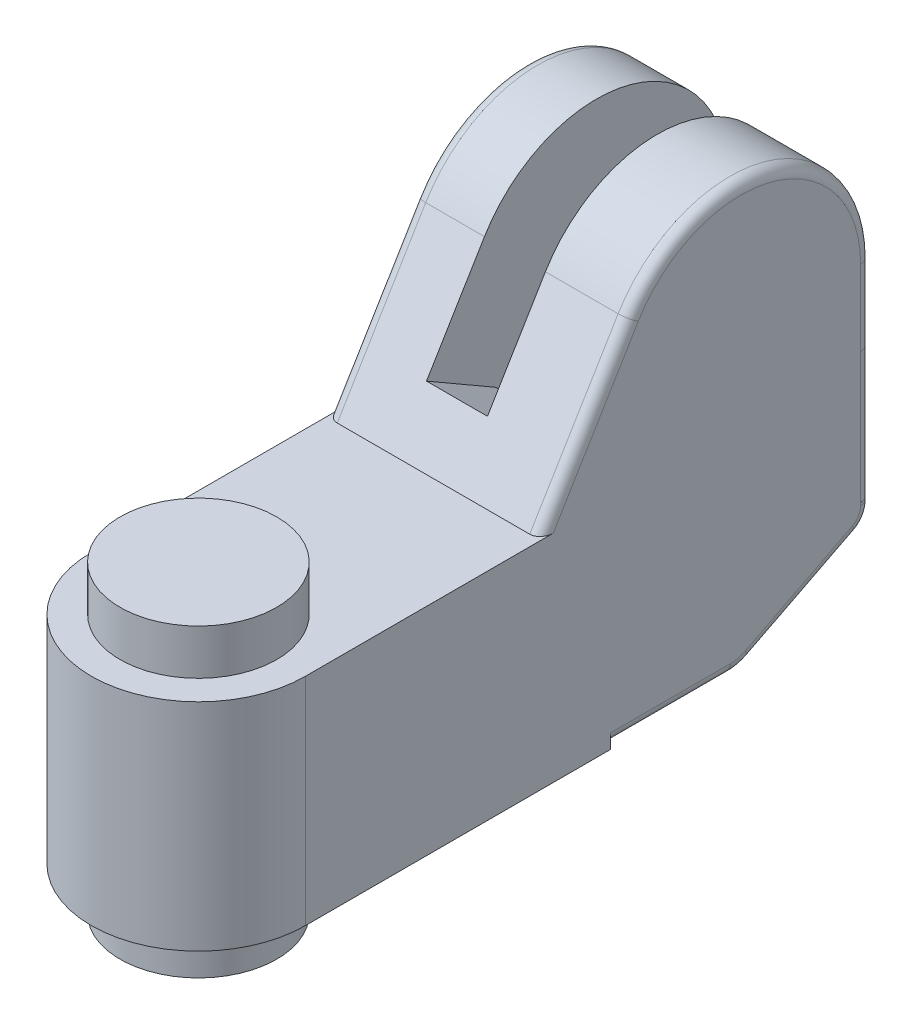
from build123d import *

# Parameters (mm, degrees)
BOSS_EXTRUDE1_DEPTH           = 12.3
CUT_EXTRUDE1_DEPTH            = 71.649345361
BOSS_EXTRUDE2_DEPTH           = 5
BOSS_EXTRUDE2_DEPTH_BACK      = 30
SKETCH3_R                     = 9
CUT_EXTRUDE2_START            = -15
CUT_EXTRUDE2_DEPTH            = 7
CUT_EXTRUDE3_DEPTH            = 14
CUT_EXTRUDE3_DEPTH_BACK       = 7
SKETCH5_R                     = 5
CUT_EXTRUDE4_DEPTH            = 1.25
FILLET1_R                     = 1.25
SKETCH8_R                     = 3.2
CUT_EXTRUDE6_DEPTH            = 25.9
SKETCH7_R                     = 1.5
SKETCH7_W                     = 24.6
SKETCH7_H                     = 0.01
CUT_EXTRUDE5_DEPTH            = 1.25
SKETCH9_R                     = 2.75
BOSS_EXTRUDE3_DEPTH           = 2
CHAMFER1_SIZE                 = 0.25
SKETCH10_R                    = 1.25
CUT_EXTRUDE7_DEPTH            = 0.1
CUT_EXTRUDE7_DRAFT            = -45
CUT_EXTRUDE7_PROFILE_2_DEPTH  = 0.1
CUT_EXTRUDE7_PROFILE_2_DRAFT  = -45
CUT_EXTRUDE7_PROFILE_3_DEPTH  = 0.1
CUT_EXTRUDE7_PROFILE_3_DRAFT  = -45
CUT_EXTRUDE7_PROFILE_4_DEPTH  = 0.1
CUT_EXTRUDE7_PROFILE_4_DRAFT  = -45
SKETCH11_W                    = 0.4
SKETCH11_H                    = 2.26495033
CUT_EXTRUDE8_DEPTH            = 0.2
CUT_EXTRUDE8_DRAFT            = -5
CUT_EXTRUDE8_PROFILE_2_DEPTH  = 0.2
CUT_EXTRUDE8_PROFILE_2_DRAFT  = -5
CUT_EXTRUDE8_PROFILE_3_DEPTH  = 0.2
CUT_EXTRUDE8_PROFILE_3_DRAFT  = -5
CUT_EXTRUDE8_PROFILE_4_DEPTH  = 0.2
CUT_EXTRUDE8_PROFILE_4_DRAFT  = -5
SKETCH12_R                    = 1.75
CUT_EXTRUDE9_DEPTH            = 0.1
CUT_EXTRUDE9_DRAFT            = -45
CUT_EXTRUDE9_PROFILE_2_DEPTH  = 0.1
CUT_EXTRUDE9_PROFILE_2_DRAFT  = -45
SKETCH13_W                    = 3.261901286
SKETCH13_H                    = 0.5
CUT_EXTRUDE10_DEPTH           = 0.2
CUT_EXTRUDE10_DRAFT           = -5
CUT_EXTRUDE10_PROFILE_2_DEPTH = 0.2
CUT_EXTRUDE10_PROFILE_2_DRAFT = -5


with BuildPart() as part:
    # Sketch1 → Boss-Extrude1 (new, symmetric)
    with BuildSketch(Plane(origin=(0, 0, 0), x_dir=(0, 0, -1), z_dir=(1, 0, 0))):
        with BuildLine():
            Line((-12.3, 0), (35, 0))
            Line((35, 0), (35, 0.4))
            Line((35, 0.4), (48.799606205, 0.4))
            ThreePointArc((48.799606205, 0.4), (49.966833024, 0.538150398), (51.069558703, 0.944967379))
            Line((51.069558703, 0.944967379), (63.361971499, 7.208264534))
            ThreePointArc((63.361971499, 7.208264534), (64.557920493, 8.313788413), (65, 9.881284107))
            Line((65, 9.881284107), (65, 33.9))
            ThreePointArc((65, 33.9), (54.018869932, 48.35159799), (37.153508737, 41.643879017))
            Line((37.153508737, 41.643879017), (27, 24.8))
            Line((27, 24.8), (-12.3, 24.8))
            Line((-12.3, 24.8), (-12.3, 0))
        make_face()
    extrude(amount=BOSS_EXTRUDE1_DEPTH, both=True)

    # Sketch2 → Cut-Extrude1 (cut, through all)
    with BuildSketch(Plane(origin=(0, 24.8, 0), x_dir=(1, 0, 0), z_dir=(0, 1, 0))):
        with BuildLine():
            Line((-12.3, 0), (-12.3, -13.3))
            Line((-12.3, -13.3), (12.3, -13.3))
            Line((12.3, -13.3), (12.3, 0))
            ThreePointArc((12.3, 0), (0, -12.3), (-12.3, 0))
        make_face()
    extrude(amount=-CUT_EXTRUDE1_DEPTH, mode=Mode.SUBTRACT)

    # Sketch3 → Boss-Extrude2 (add, two sides: drawn at the far end of the back side and taken through both)
    with BuildSketch(Plane.XZ.offset(-BOSS_EXTRUDE2_DEPTH_BACK)):
        with Locations(Location((0, 0, 0), (0, 0, 270))):
            Circle(SKETCH3_R)
    extrude(amount=BOSS_EXTRUDE2_DEPTH + BOSS_EXTRUDE2_DEPTH_BACK)

    # Sketch4 → Cut-Extrude2 (cut)
    with BuildSketch(Plane.ZY.offset(12.3).offset(CUT_EXTRUDE2_START)):
        with BuildLine():
            Line((-38.427724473, 26.020758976), (-30.496246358, 30.6))
            Line((-30.496246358, 30.6), (-37.153508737, 41.643879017))
            ThreePointArc((-37.153508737, 41.643879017), (-54.018869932, 48.35159799), (-65, 33.9))
            Line((-65, 33.9), (-65, 22.006887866))
            Line((-65, 22.006887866), (-63.8, 22.006887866))
            ThreePointArc((-63.8, 22.006887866), (-59.302339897, 21.905283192), (-54.941176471, 20.800962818))
            ThreePointArc((-54.941176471, 20.800962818), (-45.780469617, 20.551008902), (-38.427724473, 26.020758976))
        make_face()
    extrude(amount=CUT_EXTRUDE2_DEPTH, mode=Mode.SUBTRACT)

    # Sketch5 → Cut-Extrude3 (cut, two sides: drawn at the far end of the back side and taken through both)
    with BuildSketch(Plane.ZY.offset(-2.7).offset(-CUT_EXTRUDE3_DEPTH_BACK)):
        with Locations(Location((-50, 33.9, 0), (0, 0, 180))):
            Circle(SKETCH5_R)
    extrude(amount=CUT_EXTRUDE3_DEPTH + CUT_EXTRUDE3_DEPTH_BACK, mode=Mode.SUBTRACT)

    # Sketch6 → Cut-Extrude4 (cut)
    with BuildSketch(Plane.ZY.offset(12.3)):
        with BuildLine():
            Line((-35, 0.4), (-35, 14.4))
            Line((-35, 14.4), (-41, 14.4))
            ThreePointArc((-41, 14.4), (-42.414213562, 14.985786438), (-43, 16.4))
            Line((-43, 16.4), (-43, 33.9))
            ThreePointArc((-43, 33.9), (-50, 40.9), (-57, 33.9))
            Line((-57, 33.9), (-57, 3.966678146))
            Line((-57, 3.966678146), (-56.99, 3.961582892))
            Line((-56.99, 3.961582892), (-56.99, 33.9))
            ThreePointArc((-56.99, 33.9), (-50, 40.89), (-43.01, 33.9))
            Line((-43.01, 33.9), (-43.01, 16.4))
            ThreePointArc((-43.01, 16.4), (-42.42128463, 14.97871537), (-41, 14.39))
            Line((-41, 14.39), (-35.01, 14.39))
            Line((-35.01, 14.39), (-35.01, 0.4))
            Line((-35.01, 0.4), (-35, 0.4))
        make_face()
    extrude(amount=-CUT_EXTRUDE4_DEPTH, mode=Mode.SUBTRACT)

    # Fillet1
    fillet1_edges = [part.edges().sort_by_distance(p)[0] for p in [
        (12.3, 0.4, -41.899803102),
        (12.3, 0.538150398, -49.966833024),
        (12.3, 4.076615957, -57.215765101),
        (12.3, 8.313788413, -64.557920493),
        (12.3, 33.221939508, -32.076754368),
        (12.3, 48.35159799, -54.018869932),
        (-12.3, 33.221939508, -32.076754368),
        (-12.3, 48.35159799, -54.018869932),
        (-12.3, 21.890642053, -65),
        (-12.3, 8.313788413, -64.557920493),
        (-12.3, 2.453275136, -54.029779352),
        (-12.3, 0.538150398, -49.966833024),
        (12.3, 21.890642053, -65),
        (-12.3, 5.58747134, -60.18098575),
        (-12.3, 0.4, -41.904803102),
    ]]
    fillet(fillet1_edges, radius=FILLET1_R)

    # Sketch8 → Cut-Extrude6 (cut)
    with BuildSketch(Plane(origin=(0, 0, -65), x_dir=(-1, 0, 0), z_dir=(0, 0, -1))):
        with Locations(Location((0.8, 4, 0), (0, 0, 90))):
            Circle(SKETCH8_R)
        Polygon((-4.122649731, 15.6), (-3.545299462, 16.6), (-4.122649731, 17.6), (-5.277350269, 17.6), (-5.854700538, 16.6), (-5.277350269, 15.6), align=None)
        Polygon((6.877350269, 15.6), (7.454700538, 16.6), (6.877350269, 17.6), (5.722649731, 17.6), (5.145299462, 16.6), (5.722649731, 15.6), align=None)
    extrude(amount=-CUT_EXTRUDE6_DEPTH, mode=Mode.SUBTRACT)

    # Sketch7 → Cut-Extrude5 (cut)
    with BuildSketch(Plane(origin=(0, 0, -65), x_dir=(-1, 0, 0), z_dir=(0, 0, -1))):
        with Locations(Location((-4.7, 16.6, 0), (0, 0, 90))):
            Circle(SKETCH7_R)
        with Locations(Location((6.3, 16.6, 0), (0, 0, 90))):
            Circle(SKETCH7_R)
        with Locations((0, 10.205)):
            Rectangle(SKETCH7_W, SKETCH7_H)
        Polygon((-12.3, 25.2), (12.3, 25.2), (12.3, 25.19), (4.31, 25.19), (4.31, 21.996887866), (-2.71, 21.996887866), (-2.71, 25.19), (-12.3, 25.19), align=None)
    extrude(amount=-CUT_EXTRUDE5_DEPTH, mode=Mode.SUBTRACT)

    # Sketch9 → Boss-Extrude3 (add)
    with BuildSketch(Plane(origin=(0, 0, -39.1), x_dir=(-1, 0, 0), z_dir=(0, 0, -1))):
        with Locations(Location((0.8, 4, 0), (0, 0, 90))):
            Circle(SKETCH9_R)
        Polygon((1.377350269, 5), (0.222649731, 5), (-0.354700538, 4), (0.222649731, 3), (1.377350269, 3), (1.954700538, 4), align=None, mode=Mode.SUBTRACT)
    extrude(amount=BOSS_EXTRUDE3_DEPTH)

    # Chamfer1
    chamfer1_edges = [part.edges().sort_by_distance(p)[0] for p in [
        (-0.8, 1.25, -41.1),
    ]]
    chamfer(chamfer1_edges, length=CHAMFER1_SIZE)


with BuildPart() as cut_extrude7_tool:
    # Sketch10 → Cut-Extrude7 (with draft: the straight prism first)
    with BuildSketch(Plane(origin=(0, 0, -65), x_dir=(-1, 0, 0), z_dir=(0, 0, -1))):
        with Locations((-8.2, 21.6)):
            Circle(SKETCH10_R)
    extrude(amount=-CUT_EXTRUDE7_DEPTH)
    # Cut-Extrude7: the draft: its side faces are tilted about the plane it starts from
    cut_extrude7_sides = [cut_extrude7_tool.faces().sort_by_distance(p)[0] for p in [
        (9.45, 21.6, -64.95),
    ]]
    draft(cut_extrude7_sides, Plane(origin=(0, 0, -65), x_dir=(-1, 0, 0), z_dir=(0, 0, -1)), CUT_EXTRUDE7_DRAFT)


with BuildPart() as part_1:
    add(part.part)

    # Cut-Extrude7: cut by cut_extrude7_tool
    add(cut_extrude7_tool.part, mode=Mode.SUBTRACT)


with BuildPart() as cut_extrude7_profile_2_tool:
    # Sketch10 → Cut-Extrude7 profile 2 (with draft: the straight prism first)
    with BuildSketch(Plane(origin=(0, 0, -65), x_dir=(-1, 0, 0), z_dir=(0, 0, -1))):
        with Locations((9.8, 21.6)):
            Circle(SKETCH10_R)
    extrude(amount=-CUT_EXTRUDE7_PROFILE_2_DEPTH)
    # Cut-Extrude7 profile 2: the draft: its side faces are tilted about the plane it starts from
    cut_extrude7_profile_2_sides = [cut_extrude7_profile_2_tool.faces().sort_by_distance(p)[0] for p in [
        (-8.55, 21.6, -64.95),
    ]]
    draft(cut_extrude7_profile_2_sides, Plane(origin=(0, 0, -65), x_dir=(-1, 0, 0), z_dir=(0, 0, -1)), CUT_EXTRUDE7_PROFILE_2_DRAFT)


with BuildPart() as part_2:
    add(part_1.part)

    # Cut-Extrude7 profile 2: cut by cut_extrude7_profile_2_tool
    add(cut_extrude7_profile_2_tool.part, mode=Mode.SUBTRACT)


with BuildPart() as cut_extrude7_profile_3_tool:
    # Sketch10 → Cut-Extrude7 profile 3 (with draft: the straight prism first)
    with BuildSketch(Plane(origin=(0, 0, -65), x_dir=(-1, 0, 0), z_dir=(0, 0, -1))):
        with Locations((9.8, 11.6)):
            Circle(SKETCH10_R)
    extrude(amount=-CUT_EXTRUDE7_PROFILE_3_DEPTH)
    # Cut-Extrude7 profile 3: the draft: its side faces are tilted about the plane it starts from
    cut_extrude7_profile_3_sides = [cut_extrude7_profile_3_tool.faces().sort_by_distance(p)[0] for p in [
        (-8.55, 11.6, -64.95),
    ]]
    draft(cut_extrude7_profile_3_sides, Plane(origin=(0, 0, -65), x_dir=(-1, 0, 0), z_dir=(0, 0, -1)), CUT_EXTRUDE7_PROFILE_3_DRAFT)


with BuildPart() as part_3:
    add(part_2.part)

    # Cut-Extrude7 profile 3: cut by cut_extrude7_profile_3_tool
    add(cut_extrude7_profile_3_tool.part, mode=Mode.SUBTRACT)


with BuildPart() as cut_extrude7_profile_4_tool:
    # Sketch10 → Cut-Extrude7 profile 4 (with draft: the straight prism first)
    with BuildSketch(Plane(origin=(0, 0, -65), x_dir=(-1, 0, 0), z_dir=(0, 0, -1))):
        with Locations((-8.2, 11.6)):
            Circle(SKETCH10_R)
    extrude(amount=-CUT_EXTRUDE7_PROFILE_4_DEPTH)
    # Cut-Extrude7 profile 4: the draft: its side faces are tilted about the plane it starts from
    cut_extrude7_profile_4_sides = [cut_extrude7_profile_4_tool.faces().sort_by_distance(p)[0] for p in [
        (9.45, 11.6, -64.95),
    ]]
    draft(cut_extrude7_profile_4_sides, Plane(origin=(0, 0, -65), x_dir=(-1, 0, 0), z_dir=(0, 0, -1)), CUT_EXTRUDE7_PROFILE_4_DRAFT)


with BuildPart() as part_4:
    add(part_3.part)

    # Cut-Extrude7 profile 4: cut by cut_extrude7_profile_4_tool
    add(cut_extrude7_profile_4_tool.part, mode=Mode.SUBTRACT)


with BuildPart() as cut_extrude8_tool:
    # Sketch11 → Cut-Extrude8 (with draft: the straight prism first)
    with BuildSketch(Plane(origin=(0, 0, -64.9), x_dir=(-1, 0, 0), z_dir=(0, 0, -1))):
        with Locations((9.8, 21.6)):
            Rectangle(SKETCH11_W, SKETCH11_H)
    extrude(amount=-CUT_EXTRUDE8_DEPTH)
    # Cut-Extrude8: the draft: its side faces are tilted about the plane it starts from
    cut_extrude8_sides = [cut_extrude8_tool.faces().sort_by_distance(p)[0] for p in [
        (-9.8, 22.732475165, -64.8),
        (-9.6, 21.6, -64.8),
        (-9.8, 20.467524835, -64.8),
        (-10, 21.6, -64.8),
    ]]
    draft(cut_extrude8_sides, Plane(origin=(0, 0, -64.9), x_dir=(-1, 0, 0), z_dir=(0, 0, -1)), CUT_EXTRUDE8_DRAFT)


with BuildPart() as part_5:
    add(part_4.part)

    # Cut-Extrude8: cut by cut_extrude8_tool
    add(cut_extrude8_tool.part, mode=Mode.SUBTRACT)


with BuildPart() as cut_extrude8_profile_2_tool:
    # Sketch11 → Cut-Extrude8 profile 2 (with draft: the straight prism first)
    with BuildSketch(Plane(origin=(0, 0, -64.9), x_dir=(-1, 0, 0), z_dir=(0, 0, -1))):
        with Locations((-8.2, 21.6)):
            Rectangle(SKETCH11_W, SKETCH11_H)
    extrude(amount=-CUT_EXTRUDE8_PROFILE_2_DEPTH)
    # Cut-Extrude8 profile 2: the draft: its side faces are tilted about the plane it starts from
    cut_extrude8_profile_2_sides = [cut_extrude8_profile_2_tool.faces().sort_by_distance(p)[0] for p in [
        (8.4, 21.6, -64.8),
        (8.2, 20.467524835, -64.8),
        (8, 21.6, -64.8),
        (8.2, 22.732475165, -64.8),
    ]]
    draft(cut_extrude8_profile_2_sides, Plane(origin=(0, 0, -64.9), x_dir=(-1, 0, 0), z_dir=(0, 0, -1)), CUT_EXTRUDE8_PROFILE_2_DRAFT)


with BuildPart() as part_6:
    add(part_5.part)

    # Cut-Extrude8 profile 2: cut by cut_extrude8_profile_2_tool
    add(cut_extrude8_profile_2_tool.part, mode=Mode.SUBTRACT)


with BuildPart() as cut_extrude8_profile_3_tool:
    # Sketch11 → Cut-Extrude8 profile 3 (with draft: the straight prism first)
    with BuildSketch(Plane(origin=(0, 0, -64.9), x_dir=(-1, 0, 0), z_dir=(0, 0, -1))):
        with Locations((-8.2, 11.6)):
            Rectangle(SKETCH11_W, SKETCH11_H)
    extrude(amount=-CUT_EXTRUDE8_PROFILE_3_DEPTH)
    # Cut-Extrude8 profile 3: the draft: its side faces are tilted about the plane it starts from
    cut_extrude8_profile_3_sides = [cut_extrude8_profile_3_tool.faces().sort_by_distance(p)[0] for p in [
        (8.2, 12.732475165, -64.8),
        (8.4, 11.6, -64.8),
        (8.2, 10.467524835, -64.8),
        (8, 11.6, -64.8),
    ]]
    draft(cut_extrude8_profile_3_sides, Plane(origin=(0, 0, -64.9), x_dir=(-1, 0, 0), z_dir=(0, 0, -1)), CUT_EXTRUDE8_PROFILE_3_DRAFT)


with BuildPart() as part_7:
    add(part_6.part)

    # Cut-Extrude8 profile 3: cut by cut_extrude8_profile_3_tool
    add(cut_extrude8_profile_3_tool.part, mode=Mode.SUBTRACT)


with BuildPart() as cut_extrude8_profile_4_tool:
    # Sketch11 → Cut-Extrude8 profile 4 (with draft: the straight prism first)
    with BuildSketch(Plane(origin=(0, 0, -64.9), x_dir=(-1, 0, 0), z_dir=(0, 0, -1))):
        with Locations((9.8, 11.6)):
            Rectangle(SKETCH11_W, SKETCH11_H)
    extrude(amount=-CUT_EXTRUDE8_PROFILE_4_DEPTH)
    # Cut-Extrude8 profile 4: the draft: its side faces are tilted about the plane it starts from
    cut_extrude8_profile_4_sides = [cut_extrude8_profile_4_tool.faces().sort_by_distance(p)[0] for p in [
        (-9.8, 12.732475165, -64.8),
        (-9.6, 11.6, -64.8),
        (-9.8, 10.467524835, -64.8),
        (-10, 11.6, -64.8),
    ]]
    draft(cut_extrude8_profile_4_sides, Plane(origin=(0, 0, -64.9), x_dir=(-1, 0, 0), z_dir=(0, 0, -1)), CUT_EXTRUDE8_PROFILE_4_DRAFT)


with BuildPart() as part_8:
    add(part_7.part)

    # Cut-Extrude8 profile 4: cut by cut_extrude8_profile_4_tool
    add(cut_extrude8_profile_4_tool.part, mode=Mode.SUBTRACT)


with BuildPart() as cut_extrude9_tool:
    # Sketch12 → Cut-Extrude9 (with draft: the straight prism first)
    with BuildSketch(Plane.ZY.offset(12.3)):
        with Locations((-55, 7.4)):
            Circle(SKETCH12_R)
    extrude(amount=-CUT_EXTRUDE9_DEPTH)
    # Cut-Extrude9: the draft: its side faces are tilted about the plane it starts from
    cut_extrude9_sides = [cut_extrude9_tool.faces().sort_by_distance(p)[0] for p in [
        (-12.25, 7.4, -56.75),
    ]]
    draft(cut_extrude9_sides, Plane.ZY.offset(12.3), CUT_EXTRUDE9_DRAFT)


with BuildPart() as part_9:
    add(part_8.part)

    # Cut-Extrude9: cut by cut_extrude9_tool
    add(cut_extrude9_tool.part, mode=Mode.SUBTRACT)


with BuildPart() as cut_extrude9_profile_2_tool:
    # Sketch12 → Cut-Extrude9 profile 2 (with draft: the straight prism first)
    with BuildSketch(Plane.ZY.offset(12.3)):
        with Locations((-40.5, 7.4)):
            Circle(SKETCH12_R)
    extrude(amount=-CUT_EXTRUDE9_PROFILE_2_DEPTH)
    # Cut-Extrude9 profile 2: the draft: its side faces are tilted about the plane it starts from
    cut_extrude9_profile_2_sides = [cut_extrude9_profile_2_tool.faces().sort_by_distance(p)[0] for p in [
        (-12.25, 7.4, -42.25),
    ]]
    draft(cut_extrude9_profile_2_sides, Plane.ZY.offset(12.3), CUT_EXTRUDE9_PROFILE_2_DRAFT)


with BuildPart() as part_10:
    add(part_9.part)

    # Cut-Extrude9 profile 2: cut by cut_extrude9_profile_2_tool
    add(cut_extrude9_profile_2_tool.part, mode=Mode.SUBTRACT)


with BuildPart() as cut_extrude10_tool:
    # Sketch13 → Cut-Extrude10 (with draft: the straight prism first)
    with BuildSketch(Plane.ZY.offset(12.2)):
        with Locations((-40.5, 7.4)):
            Rectangle(SKETCH13_W, SKETCH13_H)
    extrude(amount=-CUT_EXTRUDE10_DEPTH)
    # Cut-Extrude10: the draft: its side faces are tilted about the plane it starts from
    cut_extrude10_sides = [cut_extrude10_tool.faces().sort_by_distance(p)[0] for p in [
        (-12.1, 7.15, -40.5),
        (-12.1, 7.4, -38.869049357),
        (-12.1, 7.65, -40.5),
        (-12.1, 7.4, -42.130950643),
    ]]
    draft(cut_extrude10_sides, Plane.ZY.offset(12.2), CUT_EXTRUDE10_DRAFT)


with BuildPart() as part_11:
    add(part_10.part)

    # Cut-Extrude10: cut by cut_extrude10_tool
    add(cut_extrude10_tool.part, mode=Mode.SUBTRACT)


with BuildPart() as cut_extrude10_profile_2_tool:
    # Sketch13 → Cut-Extrude10 profile 2 (with draft: the straight prism first)
    with BuildSketch(Plane.ZY.offset(12.2)):
        with Locations((-55, 7.4)):
            Rectangle(SKETCH13_W, SKETCH13_H)
    extrude(amount=-CUT_EXTRUDE10_PROFILE_2_DEPTH)
    # Cut-Extrude10 profile 2: the draft: its side faces are tilted about the plane it starts from
    cut_extrude10_profile_2_sides = [cut_extrude10_profile_2_tool.faces().sort_by_distance(p)[0] for p in [
        (-12.1, 7.15, -55),
        (-12.1, 7.4, -53.369049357),
        (-12.1, 7.65, -55),
        (-12.1, 7.4, -56.630950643),
    ]]
    draft(cut_extrude10_profile_2_sides, Plane.ZY.offset(12.2), CUT_EXTRUDE10_PROFILE_2_DRAFT)


with BuildPart() as part_12:
    add(part_11.part)

    # Cut-Extrude10 profile 2: cut by cut_extrude10_profile_2_tool
    add(cut_extrude10_profile_2_tool.part, mode=Mode.SUBTRACT)


solid = part_12.part
